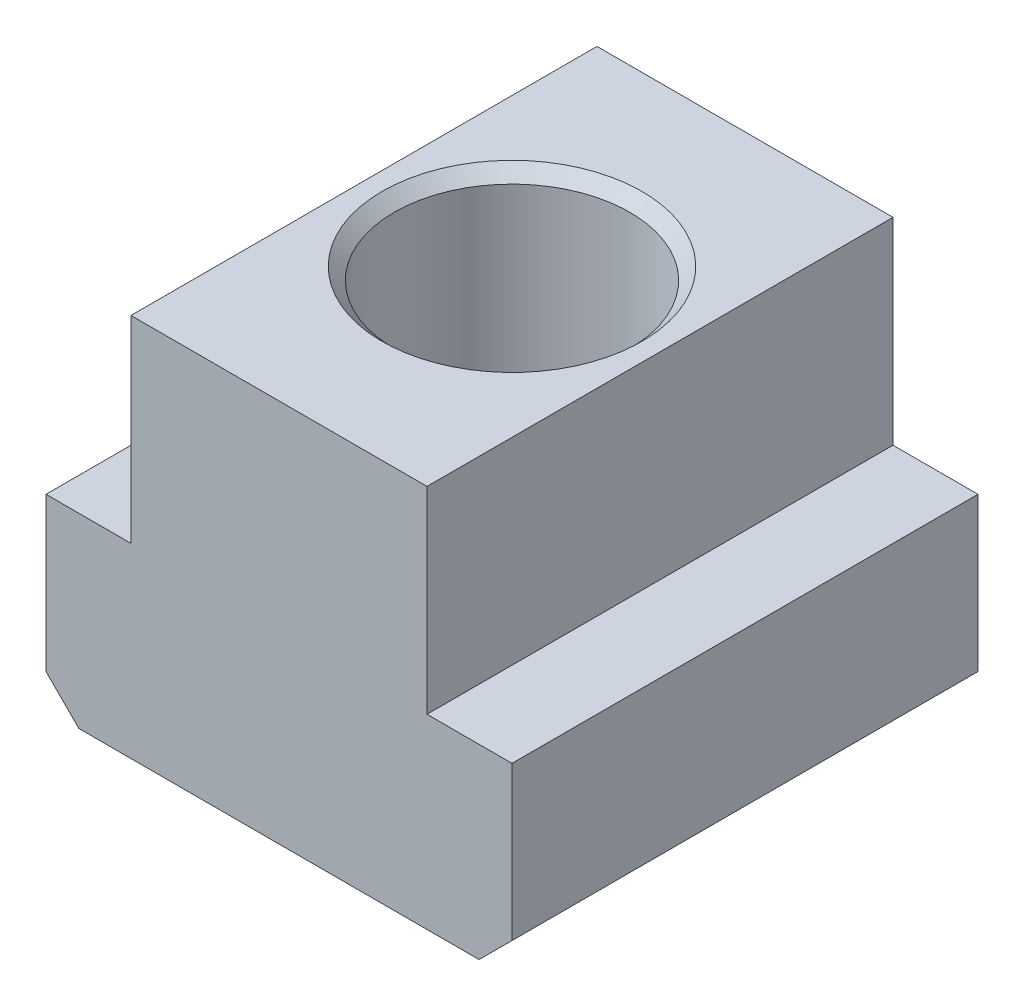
from build123d import *

# Parameters (mm, degrees)
BASENUT_DEPTH    = 85
CHAMFERS_SIZE    = 6
HOLESKE_R        = 21.5
TAPPEDHOLE_DEPTH = 119.030716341
CHAMFER1_SIZE    = 2.2


with BuildPart() as part:
    # BaseNutSke → BaseNut (new body)
    with BuildSketch(Plane.XY):
        Polygon((27, 34), (42.5, 34), (42.5, 0), (-42.5, 0), (-42.5, 34), (-27, 34), (-27, 70), (27, 70), align=None)
    extrude(amount=-BASENUT_DEPTH)

    # Chamfers
    chamfers_edges = [part.edges().sort_by_distance(p)[0] for p in [
        (42.5, 0, -42.5),
        (-42.5, 0, -42.5),
    ]]
    chamfer(chamfers_edges, length=CHAMFERS_SIZE)

    # HoleSke → TappedHole (cut, through all)
    with BuildSketch(Plane(origin=(0, 70, 0), x_dir=(-1, 0, 0), z_dir=(0, 1, 0))):
        with Locations((0, -42.5)):
            Circle(HOLESKE_R)
    extrude(amount=-TAPPEDHOLE_DEPTH, mode=Mode.SUBTRACT)

    # Chamfer1
    chamfer1_edges = [part.edges().sort_by_distance(p)[0] for p in [
        (21.5, 0, -42.5),
        (21.5, 70, -42.5),
    ]]
    chamfer(chamfer1_edges, length=CHAMFER1_SIZE)


solid = part.part
